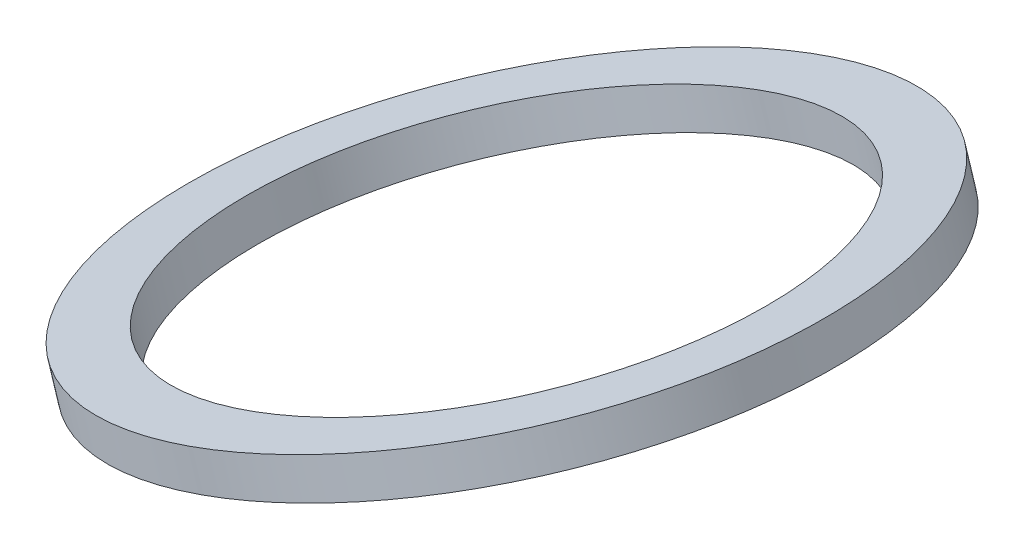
ISO-10303-21;
HEADER;
FILE_DESCRIPTION(('STEP AP214'),'2;1');
FILE_NAME('part.step','',(''),(''),'','','');
FILE_SCHEMA(('AUTOMOTIVE_DESIGN { 1 0 10303 214 1 1 1 1 }'));
ENDSEC;
DATA;
#1=APPLICATION_CONTEXT('core data for automotive mechanical design processes');
#2=APPLICATION_PROTOCOL_DEFINITION('international standard','automotive_design',2000,#1);
#3=PRODUCT_CONTEXT('',#1,'mechanical');
#4=PRODUCT('Part','Part','',(#3));
#5=PRODUCT_RELATED_PRODUCT_CATEGORY('part','',(#4));
#6=PRODUCT_DEFINITION_FORMATION('','',#4);
#7=PRODUCT_DEFINITION_CONTEXT('part definition',#1,'design');
#8=PRODUCT_DEFINITION('design','',#6,#7);
#9=PRODUCT_DEFINITION_SHAPE('','',#8);
#10=(LENGTH_UNIT() NAMED_UNIT(*) SI_UNIT(.MILLI.,.METRE.));
#11=(NAMED_UNIT(*) PLANE_ANGLE_UNIT() SI_UNIT($,.RADIAN.));
#12=(NAMED_UNIT(*) SI_UNIT($,.STERADIAN.) SOLID_ANGLE_UNIT());
#13=UNCERTAINTY_MEASURE_WITH_UNIT(LENGTH_MEASURE(1.E-05),#10,'distance_accuracy_value','');
#14=(GEOMETRIC_REPRESENTATION_CONTEXT(3) GLOBAL_UNCERTAINTY_ASSIGNED_CONTEXT((#13)) GLOBAL_UNIT_ASSIGNED_CONTEXT((#10,
#11,#12)) REPRESENTATION_CONTEXT('',''));
#15=CARTESIAN_POINT('',(0.,0.,0.));
#16=DIRECTION('',(0.,0.,1.));
#17=DIRECTION('',(1.,0.,0.));
#18=AXIS2_PLACEMENT_3D('',#15,#16,#17);
#19=CARTESIAN_POINT('',(357.677142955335,557.41885683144,0.));
#20=DIRECTION('',(-0.300714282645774,0.953714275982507,0.));
#21=DIRECTION('',(-0.953714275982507,-0.300714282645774,0.));
#22=AXIS2_PLACEMENT_3D('',#19,#20,#21);
#23=CYLINDRICAL_SURFACE('',#22,14.3000000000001);
#24=CARTESIAN_POINT('',(359.782142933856,550.742856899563,0.));
#25=DIRECTION('',(-0.300714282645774,0.953714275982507,0.));
#26=DIRECTION('',(-0.953714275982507,-0.300714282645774,0.));
#27=AXIS2_PLACEMENT_3D('',#24,#25,#26);
#28=CIRCLE('',#27,14.3000000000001);
#29=CARTESIAN_POINT('',(346.144028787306,546.442642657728,0.));
#30=VERTEX_POINT('',#29);
#31=EDGE_CURVE('E46',#30,#30,#28,.T.);
#32=CARTESIAN_POINT('',(359.180714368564,552.650285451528,0.));
#33=DIRECTION('',(-0.300714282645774,0.953714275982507,0.));
#34=DIRECTION('',(-0.953714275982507,-0.300714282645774,0.));
#35=AXIS2_PLACEMENT_3D('',#32,#33,#34);
#36=CIRCLE('',#35,14.3000000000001);
#37=CARTESIAN_POINT('',(345.542600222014,548.350071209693,0.));
#38=VERTEX_POINT('',#37);
#39=EDGE_CURVE('E10',#38,#38,#36,.T.);
#40=CARTESIAN_POINT('',(346.144028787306,546.442642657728,0.));
#41=CARTESIAN_POINT('',(346.137763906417,546.462511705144,0.));
#42=CARTESIAN_POINT('',(346.131499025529,546.482380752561,0.));
#43=CARTESIAN_POINT('',(346.118969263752,546.522118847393,0.));
#44=CARTESIAN_POINT('',(346.112704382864,546.541987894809,0.));
#45=CARTESIAN_POINT('',(346.100174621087,546.581725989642,0.));
#46=CARTESIAN_POINT('',(346.093909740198,546.601595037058,0.));
#47=CARTESIAN_POINT('',(346.081379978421,546.641333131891,0.));
#48=CARTESIAN_POINT('',(346.075115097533,546.661202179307,0.));
#49=CARTESIAN_POINT('',(346.062585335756,546.70094027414,0.));
#50=CARTESIAN_POINT('',(346.056320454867,546.720809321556,0.));
#51=CARTESIAN_POINT('',(346.043790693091,546.760547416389,0.));
#52=CARTESIAN_POINT('',(346.037525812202,546.780416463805,0.));
#53=CARTESIAN_POINT('',(346.024996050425,546.820154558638,0.));
#54=CARTESIAN_POINT('',(346.018731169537,546.840023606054,0.));
#55=CARTESIAN_POINT('',(346.00620140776,546.879761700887,0.));
#56=CARTESIAN_POINT('',(345.999936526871,546.899630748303,0.));
#57=CARTESIAN_POINT('',(345.987406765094,546.939368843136,0.));
#58=CARTESIAN_POINT('',(345.981141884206,546.959237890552,0.));
#59=CARTESIAN_POINT('',(345.968612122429,546.998975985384,0.));
#60=CARTESIAN_POINT('',(345.962347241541,547.018845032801,0.));
#61=CARTESIAN_POINT('',(345.949817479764,547.058583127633,0.));
#62=CARTESIAN_POINT('',(345.943552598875,547.07845217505,0.));
#63=CARTESIAN_POINT('',(345.931022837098,547.118190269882,0.));
#64=CARTESIAN_POINT('',(345.92475795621,547.138059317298,0.));
#65=CARTESIAN_POINT('',(345.912228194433,547.177797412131,0.));
#66=CARTESIAN_POINT('',(345.905963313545,547.197666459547,0.));
#67=CARTESIAN_POINT('',(345.893433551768,547.23740455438,0.));
#68=CARTESIAN_POINT('',(345.887168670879,547.257273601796,0.));
#69=CARTESIAN_POINT('',(345.874638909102,547.297011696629,0.));
#70=CARTESIAN_POINT('',(345.868374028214,547.316880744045,0.));
#71=CARTESIAN_POINT('',(345.855844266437,547.356618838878,0.));
#72=CARTESIAN_POINT('',(345.849579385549,547.376487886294,0.));
#73=CARTESIAN_POINT('',(345.837049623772,547.416225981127,0.));
#74=CARTESIAN_POINT('',(345.830784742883,547.436095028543,0.));
#75=CARTESIAN_POINT('',(345.818254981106,547.475833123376,0.));
#76=CARTESIAN_POINT('',(345.811990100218,547.495702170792,0.));
#77=CARTESIAN_POINT('',(345.799460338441,547.535440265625,0.));
#78=CARTESIAN_POINT('',(345.793195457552,547.555309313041,0.));
#79=CARTESIAN_POINT('',(345.780665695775,547.595047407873,0.));
#80=CARTESIAN_POINT('',(345.774400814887,547.61491645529,0.));
#81=CARTESIAN_POINT('',(345.76187105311,547.654654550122,0.));
#82=CARTESIAN_POINT('',(345.755606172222,547.674523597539,0.));
#83=CARTESIAN_POINT('',(345.743076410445,547.714261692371,0.));
#84=CARTESIAN_POINT('',(345.736811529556,547.734130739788,0.));
#85=CARTESIAN_POINT('',(345.724281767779,547.77386883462,0.));
#86=CARTESIAN_POINT('',(345.718016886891,547.793737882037,0.));
#87=CARTESIAN_POINT('',(345.705487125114,547.833475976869,0.));
#88=CARTESIAN_POINT('',(345.699222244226,547.853345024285,0.));
#89=CARTESIAN_POINT('',(345.686692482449,547.893083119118,0.));
#90=CARTESIAN_POINT('',(345.68042760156,547.912952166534,0.));
#91=CARTESIAN_POINT('',(345.667897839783,547.952690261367,0.));
#92=CARTESIAN_POINT('',(345.661632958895,547.972559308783,0.));
#93=CARTESIAN_POINT('',(345.649103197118,548.012297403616,0.));
#94=CARTESIAN_POINT('',(345.642838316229,548.032166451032,0.));
#95=CARTESIAN_POINT('',(345.630308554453,548.071904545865,0.));
#96=CARTESIAN_POINT('',(345.624043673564,548.091773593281,0.));
#97=CARTESIAN_POINT('',(345.611513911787,548.131511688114,0.));
#98=CARTESIAN_POINT('',(345.605249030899,548.15138073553,0.));
#99=CARTESIAN_POINT('',(345.592719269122,548.191118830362,0.));
#100=CARTESIAN_POINT('',(345.586454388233,548.210987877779,0.));
#101=CARTESIAN_POINT('',(345.573924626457,548.250725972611,0.));
#102=CARTESIAN_POINT('',(345.567659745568,548.270595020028,0.));
#103=CARTESIAN_POINT('',(345.555129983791,548.31033311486,0.));
#104=CARTESIAN_POINT('',(345.548865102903,548.330202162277,0.));
#105=CARTESIAN_POINT('',(345.542600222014,548.350071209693,0.));
#106=B_SPLINE_CURVE_WITH_KNOTS('',3,(#40,#41,#42,#43,#44,#45,#46,#47,#48,#49,#50,#51,#52,#53,
#54,#55,#56,#57,#58,#59,#60,#61,#62,#63,#64,#65,#66,#67,#68,#69,#70,#71,#72,#73,#74,#75,#76,#77,
#78,#79,#80,#81,#82,#83,#84,#85,#86,#87,#88,#89,#90,#91,#92,#93,#94,#95,#96,#97,#98,#99,#100,
#101,#102,#103,#104,#105),.UNSPECIFIED.,.F.,.F.,(4,2,2,2,2,2,2,2,2,2,2,2,2,2,2,2,2,2,2,2,2,2,2,
2,2,2,2,2,2,2,2,2,4),(0.,0.0624999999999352,0.124999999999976,0.187499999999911,
0.249999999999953,0.312499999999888,0.374999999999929,0.43749999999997,0.499999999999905,
0.562499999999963,0.624999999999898,0.687499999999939,0.74999999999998,0.812499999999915,
0.874999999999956,0.937499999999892,0.999999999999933,1.06249999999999,1.12499999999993,
1.18749999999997,1.2499999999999,1.31249999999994,1.37499999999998,1.43749999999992,
1.49999999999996,1.56249999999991,1.62499999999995,1.68749999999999,1.74999999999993,
1.81249999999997,1.87499999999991,1.93749999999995,1.99999999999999),.UNSPECIFIED.);
#107=EDGE_CURVE('BSEAM32',#30,#38,#106,.T.);
#108=ORIENTED_EDGE('',*,*,#31,.F.);
#109=ORIENTED_EDGE('',*,*,#39,.T.);
#110=ORIENTED_EDGE('',*,*,#107,.T.);
#111=ORIENTED_EDGE('',*,*,#107,.F.);
#112=EDGE_LOOP('',(#108,#110,#109,#111));
#113=FACE_BOUND('',#112,.T.);
#114=ADVANCED_FACE('F32',(#113),#23,.F.);
#115=CARTESIAN_POINT('',(372.818828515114,556.950499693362,0.));
#116=DIRECTION('',(0.300714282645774,-0.953714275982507,0.));
#117=DIRECTION('',(0.953714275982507,0.300714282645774,0.));
#118=AXIS2_PLACEMENT_3D('',#115,#116,#117);
#119=PLANE('',#118);
#120=ORIENTED_EDGE('',*,*,#39,.F.);
#121=EDGE_LOOP('',(#120));
#122=FACE_BOUND('',#121,.T.);
#123=CARTESIAN_POINT('',(359.180714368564,552.650285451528,0.));
#124=DIRECTION('',(-0.300714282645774,0.953714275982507,0.));
#125=DIRECTION('',(-0.953714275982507,-0.300714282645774,0.));
#126=AXIS2_PLACEMENT_3D('',#123,#124,#125);
#127=CIRCLE('',#126,17.5);
#128=CARTESIAN_POINT('',(342.49071453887,547.387785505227,0.));
#129=VERTEX_POINT('',#128);
#130=EDGE_CURVE('E38',#129,#129,#127,.T.);
#131=ORIENTED_EDGE('',*,*,#130,.T.);
#132=EDGE_LOOP('',(#131));
#133=FACE_BOUND('',#132,.T.);
#134=ADVANCED_FACE('F55',(#122,#133),#119,.F.);
#135=CARTESIAN_POINT('',(357.677142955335,557.41885683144,0.));
#136=DIRECTION('',(-0.300714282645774,0.953714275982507,0.));
#137=DIRECTION('',(-0.953714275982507,-0.300714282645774,0.));
#138=AXIS2_PLACEMENT_3D('',#135,#136,#137);
#139=CYLINDRICAL_SURFACE('',#138,17.5);
#140=CARTESIAN_POINT('',(359.782142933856,550.742856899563,0.));
#141=DIRECTION('',(-0.300714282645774,0.953714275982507,0.));
#142=DIRECTION('',(-0.953714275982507,-0.300714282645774,0.));
#143=AXIS2_PLACEMENT_3D('',#140,#141,#142);
#144=CIRCLE('',#143,17.5);
#145=CARTESIAN_POINT('',(343.092143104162,545.480356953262,0.));
#146=VERTEX_POINT('',#145);
#147=EDGE_CURVE('E42',#146,#146,#144,.T.);
#148=CARTESIAN_POINT('',(342.49071453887,547.387785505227,0.));
#149=CARTESIAN_POINT('',(342.496979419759,547.36791645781,0.));
#150=CARTESIAN_POINT('',(342.503244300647,547.348047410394,0.));
#151=CARTESIAN_POINT('',(342.515774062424,547.308309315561,0.));
#152=CARTESIAN_POINT('',(342.522038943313,547.288440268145,0.));
#153=CARTESIAN_POINT('',(342.534568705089,547.248702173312,0.));
#154=CARTESIAN_POINT('',(342.540833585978,547.228833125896,0.));
#155=CARTESIAN_POINT('',(342.553363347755,547.189095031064,0.));
#156=CARTESIAN_POINT('',(342.559628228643,547.169225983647,0.));
#157=CARTESIAN_POINT('',(342.57215799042,547.129487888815,0.));
#158=CARTESIAN_POINT('',(342.578422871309,547.109618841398,0.));
#159=CARTESIAN_POINT('',(342.590952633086,547.069880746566,0.));
#160=CARTESIAN_POINT('',(342.597217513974,547.050011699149,0.));
#161=CARTESIAN_POINT('',(342.609747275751,547.010273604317,0.));
#162=CARTESIAN_POINT('',(342.616012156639,546.990404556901,0.));
#163=CARTESIAN_POINT('',(342.628541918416,546.950666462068,0.));
#164=CARTESIAN_POINT('',(342.634806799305,546.930797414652,0.));
#165=CARTESIAN_POINT('',(342.647336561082,546.891059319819,0.));
#166=CARTESIAN_POINT('',(342.65360144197,546.871190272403,0.));
#167=CARTESIAN_POINT('',(342.666131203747,546.83145217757,0.));
#168=CARTESIAN_POINT('',(342.672396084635,546.811583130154,0.));
#169=CARTESIAN_POINT('',(342.684925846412,546.771845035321,0.));
#170=CARTESIAN_POINT('',(342.691190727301,546.751975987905,0.));
#171=CARTESIAN_POINT('',(342.703720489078,546.712237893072,0.));
#172=CARTESIAN_POINT('',(342.709985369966,546.692368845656,0.));
#173=CARTESIAN_POINT('',(342.722515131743,546.652630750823,0.));
#174=CARTESIAN_POINT('',(342.728780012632,546.632761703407,0.));
#175=CARTESIAN_POINT('',(342.741309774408,546.593023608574,0.));
#176=CARTESIAN_POINT('',(342.747574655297,546.573154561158,0.));
#177=CARTESIAN_POINT('',(342.760104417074,546.533416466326,0.));
#178=CARTESIAN_POINT('',(342.766369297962,546.513547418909,0.));
#179=CARTESIAN_POINT('',(342.778899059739,546.473809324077,0.));
#180=CARTESIAN_POINT('',(342.785163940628,546.45394027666,0.));
#181=CARTESIAN_POINT('',(342.797693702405,546.414202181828,0.));
#182=CARTESIAN_POINT('',(342.803958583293,546.394333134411,0.));
#183=CARTESIAN_POINT('',(342.81648834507,546.354595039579,0.));
#184=CARTESIAN_POINT('',(342.822753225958,546.334725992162,0.));
#185=CARTESIAN_POINT('',(342.835282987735,546.29498789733,0.));
#186=CARTESIAN_POINT('',(342.841547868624,546.275118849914,0.));
#187=CARTESIAN_POINT('',(342.854077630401,546.235380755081,0.));
#188=CARTESIAN_POINT('',(342.860342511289,546.215511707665,0.));
#189=CARTESIAN_POINT('',(342.872872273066,546.175773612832,0.));
#190=CARTESIAN_POINT('',(342.879137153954,546.155904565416,0.));
#191=CARTESIAN_POINT('',(342.891666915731,546.116166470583,0.));
#192=CARTESIAN_POINT('',(342.89793179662,546.096297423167,0.));
#193=CARTESIAN_POINT('',(342.910461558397,546.056559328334,0.));
#194=CARTESIAN_POINT('',(342.916726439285,546.036690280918,0.));
#195=CARTESIAN_POINT('',(342.929256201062,545.996952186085,0.));
#196=CARTESIAN_POINT('',(342.935521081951,545.977083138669,0.));
#197=CARTESIAN_POINT('',(342.948050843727,545.937345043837,0.));
#198=CARTESIAN_POINT('',(342.954315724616,545.91747599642,0.));
#199=CARTESIAN_POINT('',(342.966845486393,545.877737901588,0.));
#200=CARTESIAN_POINT('',(342.973110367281,545.857868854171,0.));
#201=CARTESIAN_POINT('',(342.985640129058,545.818130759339,0.));
#202=CARTESIAN_POINT('',(342.991905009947,545.798261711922,0.));
#203=CARTESIAN_POINT('',(343.004434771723,545.75852361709,0.));
#204=CARTESIAN_POINT('',(343.010699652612,545.738654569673,0.));
#205=CARTESIAN_POINT('',(343.023229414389,545.698916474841,0.));
#206=CARTESIAN_POINT('',(343.029494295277,545.679047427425,0.));
#207=CARTESIAN_POINT('',(343.042024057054,545.639309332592,0.));
#208=CARTESIAN_POINT('',(343.048288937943,545.619440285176,0.));
#209=CARTESIAN_POINT('',(343.06081869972,545.579702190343,0.));
#210=CARTESIAN_POINT('',(343.067083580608,545.559833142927,0.));
#211=CARTESIAN_POINT('',(343.079613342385,545.520095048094,0.));
#212=CARTESIAN_POINT('',(343.085878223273,545.500226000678,0.));
#213=CARTESIAN_POINT('',(343.092143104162,545.480356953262,0.));
#214=B_SPLINE_CURVE_WITH_KNOTS('',3,(#148,#149,#150,#151,#152,#153,#154,#155,#156,#157,#158,
#159,#160,#161,#162,#163,#164,#165,#166,#167,#168,#169,#170,#171,#172,#173,#174,#175,#176,#177,
#178,#179,#180,#181,#182,#183,#184,#185,#186,#187,#188,#189,#190,#191,#192,#193,#194,#195,#196,
#197,#198,#199,#200,#201,#202,#203,#204,#205,#206,#207,#208,#209,#210,#211,#212,#213),
.UNSPECIFIED.,.F.,.F.,(4,2,2,2,2,2,2,2,2,2,2,2,2,2,2,2,2,2,2,2,2,2,2,2,2,2,2,2,2,2,2,2,4),(0.,
0.0625000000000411,0.125000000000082,0.187500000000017,0.250000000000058,0.312499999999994,
0.375000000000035,0.437500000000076,0.500000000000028,0.562500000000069,0.625000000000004,
0.687500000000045,0.750000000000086,0.812500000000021,0.875000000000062,0.937499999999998,
1.00000000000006,1.0625000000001,1.12500000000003,1.18750000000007,1.25000000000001,
1.31250000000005,1.37500000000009,1.43750000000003,1.50000000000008,1.56250000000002,
1.62500000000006,1.6875000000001,1.75000000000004,1.81250000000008,1.87500000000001,
1.93750000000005,1.99999999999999),.UNSPECIFIED.);
#215=EDGE_CURVE('BSEAM59',#129,#146,#214,.T.);
#216=ORIENTED_EDGE('',*,*,#130,.F.);
#217=ORIENTED_EDGE('',*,*,#147,.T.);
#218=ORIENTED_EDGE('',*,*,#215,.T.);
#219=ORIENTED_EDGE('',*,*,#215,.F.);
#220=EDGE_LOOP('',(#216,#218,#217,#219));
#221=FACE_BOUND('',#220,.T.);
#222=ADVANCED_FACE('F59',(#221),#139,.T.);
#223=CARTESIAN_POINT('',(376.47214276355,556.005356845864,0.));
#224=DIRECTION('',(-0.300714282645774,0.953714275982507,0.));
#225=DIRECTION('',(-0.953714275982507,-0.300714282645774,0.));
#226=AXIS2_PLACEMENT_3D('',#223,#224,#225);
#227=PLANE('',#226);
#228=ORIENTED_EDGE('',*,*,#147,.F.);
#229=EDGE_LOOP('',(#228));
#230=FACE_BOUND('',#229,.T.);
#231=ORIENTED_EDGE('',*,*,#31,.T.);
#232=EDGE_LOOP('',(#231));
#233=FACE_BOUND('',#232,.T.);
#234=ADVANCED_FACE('F52',(#230,#233),#227,.F.);
#235=CLOSED_SHELL('',(#114,#134,#222,#234));
#236=MANIFOLD_SOLID_BREP('B2',#235);
#237=ADVANCED_BREP_SHAPE_REPRESENTATION('',(#18,#236),#14);
#238=SHAPE_DEFINITION_REPRESENTATION(#9,#237);
ENDSEC;
END-ISO-10303-21;
